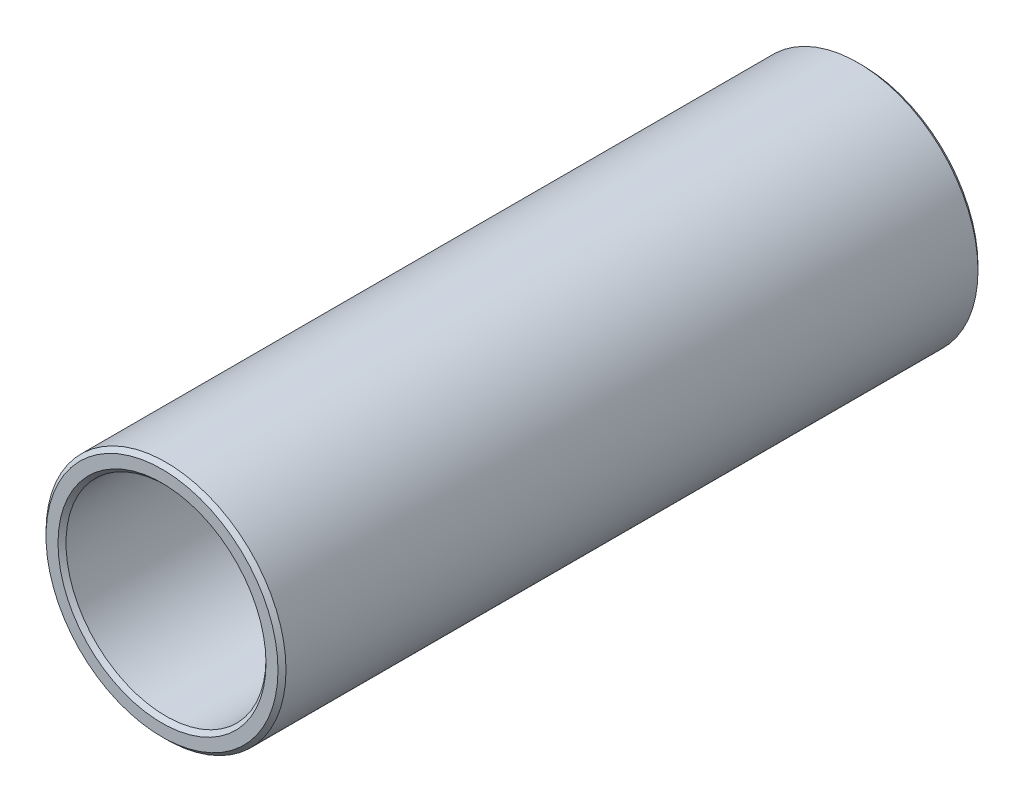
from build123d import *

# Parameters (mm, degrees)
SKETCH_1_R      = 6
SKETCH_1_R_2    = 5
EXTRUDE_1_DEPTH = 35
CHAMFER_1_SIZE  = 0.2


with BuildPart() as part:
    # Sketch 1 → Extrude 1 (new body)
    with BuildSketch(Plane.XY):
        Circle(SKETCH_1_R)
        Circle(SKETCH_1_R_2, mode=Mode.SUBTRACT)
    extrude(amount=EXTRUDE_1_DEPTH)

    # Chamfer 1
    chamfer_1_edges = [part.edges().sort_by_distance(p)[0] for p in [
        (-6, 0, 0),
        (-6, 0, 35),
        (-5, 0, 0),
        (-5, 0, 35),
    ]]
    chamfer(chamfer_1_edges, length=CHAMFER_1_SIZE)


solid = part.part
